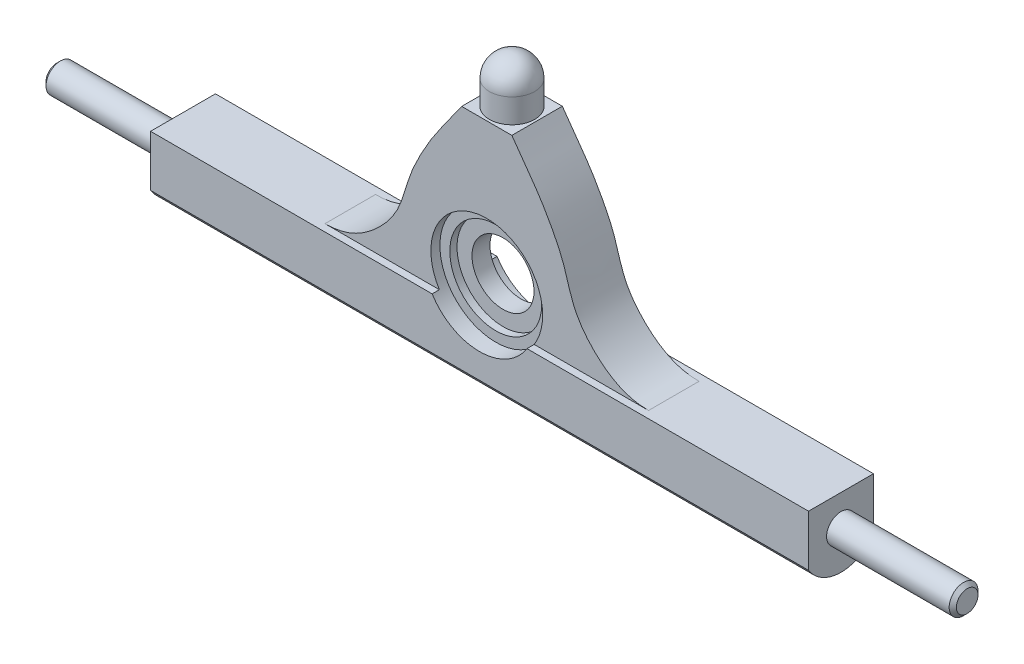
ISO-10303-21;
HEADER;
FILE_DESCRIPTION(('STEP AP214'),'2;1');
FILE_NAME('part.step','',(''),(''),'','','');
FILE_SCHEMA(('AUTOMOTIVE_DESIGN { 1 0 10303 214 1 1 1 1 }'));
ENDSEC;
DATA;
#1=APPLICATION_CONTEXT('core data for automotive mechanical design processes');
#2=APPLICATION_PROTOCOL_DEFINITION('international standard','automotive_design',2000,#1);
#3=PRODUCT_CONTEXT('',#1,'mechanical');
#4=PRODUCT('Part','Part','',(#3));
#5=PRODUCT_RELATED_PRODUCT_CATEGORY('part','',(#4));
#6=PRODUCT_DEFINITION_FORMATION('','',#4);
#7=PRODUCT_DEFINITION_CONTEXT('part definition',#1,'design');
#8=PRODUCT_DEFINITION('design','',#6,#7);
#9=PRODUCT_DEFINITION_SHAPE('','',#8);
#10=(LENGTH_UNIT() NAMED_UNIT(*) SI_UNIT(.MILLI.,.METRE.));
#11=(NAMED_UNIT(*) PLANE_ANGLE_UNIT() SI_UNIT($,.RADIAN.));
#12=(NAMED_UNIT(*) SI_UNIT($,.STERADIAN.) SOLID_ANGLE_UNIT());
#13=UNCERTAINTY_MEASURE_WITH_UNIT(LENGTH_MEASURE(1.E-05),#10,'distance_accuracy_value','');
#14=(GEOMETRIC_REPRESENTATION_CONTEXT(3) GLOBAL_UNCERTAINTY_ASSIGNED_CONTEXT((#13)) GLOBAL_UNIT_ASSIGNED_CONTEXT((#10,
#11,#12)) REPRESENTATION_CONTEXT('',''));
#15=CARTESIAN_POINT('',(0.,0.,0.));
#16=DIRECTION('',(0.,0.,1.));
#17=DIRECTION('',(1.,0.,0.));
#18=AXIS2_PLACEMENT_3D('',#15,#16,#17);
#19=CARTESIAN_POINT('',(0.,16.8,-9.));
#20=DIRECTION('',(0.,0.,1.));
#21=DIRECTION('',(1.,0.,0.));
#22=AXIS2_PLACEMENT_3D('',#19,#20,#21);
#23=CYLINDRICAL_SURFACE('',#22,8.6);
#24=CARTESIAN_POINT('',(0.,16.8,2.5));
#25=DIRECTION('',(0.,0.,1.));
#26=DIRECTION('',(1.,0.,0.));
#27=AXIS2_PLACEMENT_3D('',#24,#25,#26);
#28=CIRCLE('',#27,8.6);
#29=CARTESIAN_POINT('',(8.6,16.8,2.5));
#30=VERTEX_POINT('',#29);
#31=EDGE_CURVE('E167',#30,#30,#28,.F.);
#32=ORIENTED_EDGE('',*,*,#31,.F.);
#33=EDGE_LOOP('',(#32));
#34=FACE_BOUND('',#33,.T.);
#35=CARTESIAN_POINT('',(0.,16.8,-2.5));
#36=DIRECTION('',(0.,0.,-1.));
#37=DIRECTION('',(-1.,0.,0.));
#38=AXIS2_PLACEMENT_3D('',#35,#36,#37);
#39=CIRCLE('',#38,8.6);
#40=CARTESIAN_POINT('',(-8.59999999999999,16.8,-2.5));
#41=VERTEX_POINT('',#40);
#42=EDGE_CURVE('E129',#41,#41,#39,.F.);
#43=ORIENTED_EDGE('',*,*,#42,.F.);
#44=EDGE_LOOP('',(#43));
#45=FACE_BOUND('',#44,.T.);
#46=ADVANCED_FACE('F33',(#34,#45),#23,.F.);
#47=CARTESIAN_POINT('',(91.25,8.6,-9.));
#48=DIRECTION('',(0.,-1.,0.));
#49=DIRECTION('',(0.,0.,-1.));
#50=AXIS2_PLACEMENT_3D('',#47,#48,#49);
#51=PLANE('',#50);
#52=DIRECTION('',(0.,0.,-1.));
#53=VECTOR('',#52,1.);
#54=CARTESIAN_POINT('',(13.1533265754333,8.6,-4.5));
#55=LINE('',#54,#53);
#56=CARTESIAN_POINT('',(13.1533265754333,8.6,-7.));
#57=VERTEX_POINT('',#56);
#58=CARTESIAN_POINT('',(13.1533265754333,8.6,-9.));
#59=VERTEX_POINT('',#58);
#60=EDGE_CURVE('E123',#57,#59,#55,.T.);
#61=ORIENTED_EDGE('',*,*,#60,.F.);
#62=DIRECTION('',(1.,0.,0.));
#63=VECTOR('',#62,1.);
#64=CARTESIAN_POINT('',(44.8718331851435,8.6,-7.));
#65=LINE('',#64,#63);
#66=CARTESIAN_POINT('',(44.8718331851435,8.6,-7.));
#67=VERTEX_POINT('',#66);
#68=EDGE_CURVE('E248',#57,#67,#65,.T.);
#69=ORIENTED_EDGE('',*,*,#68,.T.);
#70=DIRECTION('',(0.,0.,-1.));
#71=VECTOR('',#70,1.);
#72=CARTESIAN_POINT('',(44.8718331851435,8.6,7.));
#73=LINE('',#72,#71);
#74=CARTESIAN_POINT('',(44.8718331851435,8.6,7.));
#75=VERTEX_POINT('',#74);
#76=EDGE_CURVE('E268',#75,#67,#73,.T.);
#77=ORIENTED_EDGE('',*,*,#76,.F.);
#78=DIRECTION('',(1.,0.,0.));
#79=VECTOR('',#78,1.);
#80=CARTESIAN_POINT('',(44.8718331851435,8.6,7.));
#81=LINE('',#80,#79);
#82=CARTESIAN_POINT('',(13.1533265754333,8.6,7.));
#83=VERTEX_POINT('',#82);
#84=EDGE_CURVE('E310',#83,#75,#81,.T.);
#85=ORIENTED_EDGE('',*,*,#84,.F.);
#86=DIRECTION('',(0.,0.,1.));
#87=VECTOR('',#86,1.);
#88=CARTESIAN_POINT('',(13.1533265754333,8.6,4.5));
#89=LINE('',#88,#87);
#90=CARTESIAN_POINT('',(13.1533265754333,8.6,9.));
#91=VERTEX_POINT('',#90);
#92=EDGE_CURVE('E56',#83,#91,#89,.T.);
#93=ORIENTED_EDGE('',*,*,#92,.T.);
#94=DIRECTION('',(-1.,0.,0.));
#95=VECTOR('',#94,1.);
#96=CARTESIAN_POINT('',(91.25,8.6,9.));
#97=LINE('',#96,#95);
#98=CARTESIAN_POINT('',(91.25,8.6,9.));
#99=VERTEX_POINT('',#98);
#100=EDGE_CURVE('E146',#99,#91,#97,.T.);
#101=ORIENTED_EDGE('',*,*,#100,.F.);
#102=DIRECTION('',(0.,0.,1.));
#103=VECTOR('',#102,1.);
#104=CARTESIAN_POINT('',(91.25,8.6,-9.));
#105=LINE('',#104,#103);
#106=CARTESIAN_POINT('',(91.25,8.6,-9.));
#107=VERTEX_POINT('',#106);
#108=EDGE_CURVE('E282',#107,#99,#105,.T.);
#109=ORIENTED_EDGE('',*,*,#108,.F.);
#110=DIRECTION('',(-1.,0.,0.));
#111=VECTOR('',#110,1.);
#112=CARTESIAN_POINT('',(91.25,8.6,-9.));
#113=LINE('',#112,#111);
#114=EDGE_CURVE('E145',#107,#59,#113,.T.);
#115=ORIENTED_EDGE('',*,*,#114,.T.);
#116=EDGE_LOOP('',(#61,#69,#77,#85,#93,#101,#109,#115));
#117=FACE_BOUND('',#116,.T.);
#118=ADVANCED_FACE('F196',(#117),#51,.F.);
#119=DIRECTION('',(0.,0.,-1.));
#120=VECTOR('',#119,1.);
#121=CARTESIAN_POINT('',(-13.1533265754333,8.6,-4.5));
#122=LINE('',#121,#120);
#123=CARTESIAN_POINT('',(-13.1533265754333,8.6,-9.));
#124=VERTEX_POINT('',#123);
#125=CARTESIAN_POINT('',(-13.1533265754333,8.6,-7.));
#126=VERTEX_POINT('',#125);
#127=EDGE_CURVE('E48',#124,#126,#122,.F.);
#128=ORIENTED_EDGE('',*,*,#127,.F.);
#129=CARTESIAN_POINT('',(-91.25,8.6,-9.));
#130=VERTEX_POINT('',#129);
#131=EDGE_CURVE('E135',#124,#130,#113,.T.);
#132=ORIENTED_EDGE('',*,*,#131,.T.);
#133=DIRECTION('',(0.,0.,1.));
#134=VECTOR('',#133,1.);
#135=CARTESIAN_POINT('',(-91.25,8.6,-9.));
#136=LINE('',#135,#134);
#137=CARTESIAN_POINT('',(-91.25,8.6,9.));
#138=VERTEX_POINT('',#137);
#139=EDGE_CURVE('E278',#130,#138,#136,.T.);
#140=ORIENTED_EDGE('',*,*,#139,.T.);
#141=CARTESIAN_POINT('',(-13.1533265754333,8.6,9.));
#142=VERTEX_POINT('',#141);
#143=EDGE_CURVE('E150',#142,#138,#97,.T.);
#144=ORIENTED_EDGE('',*,*,#143,.F.);
#145=DIRECTION('',(0.,0.,1.));
#146=VECTOR('',#145,1.);
#147=CARTESIAN_POINT('',(-13.1533265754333,8.6,4.5));
#148=LINE('',#147,#146);
#149=CARTESIAN_POINT('',(-13.1533265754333,8.6,7.));
#150=VERTEX_POINT('',#149);
#151=EDGE_CURVE('E302',#142,#150,#148,.F.);
#152=ORIENTED_EDGE('',*,*,#151,.T.);
#153=CARTESIAN_POINT('',(-44.8718331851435,8.6,7.));
#154=VERTEX_POINT('',#153);
#155=EDGE_CURVE('E237',#154,#150,#81,.T.);
#156=ORIENTED_EDGE('',*,*,#155,.F.);
#157=DIRECTION('',(0.,0.,-1.));
#158=VECTOR('',#157,1.);
#159=CARTESIAN_POINT('',(-44.8718331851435,8.6,7.));
#160=LINE('',#159,#158);
#161=CARTESIAN_POINT('',(-44.8718331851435,8.6,-7.));
#162=VERTEX_POINT('',#161);
#163=EDGE_CURVE('E271',#154,#162,#160,.T.);
#164=ORIENTED_EDGE('',*,*,#163,.T.);
#165=EDGE_CURVE('E138',#162,#126,#65,.T.);
#166=ORIENTED_EDGE('',*,*,#165,.T.);
#167=EDGE_LOOP('',(#128,#132,#140,#144,#152,#156,#164,#166));
#168=FACE_BOUND('',#167,.T.);
#169=ADVANCED_FACE('F133',(#168),#51,.F.);
#170=CARTESIAN_POINT('',(126.25,0.,0.));
#171=DIRECTION('',(1.,0.,0.));
#172=DIRECTION('',(0.,0.,-1.));
#173=AXIS2_PLACEMENT_3D('',#170,#171,#172);
#174=CYLINDRICAL_SURFACE('',#173,4.00000000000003);
#175=CARTESIAN_POINT('',(125.25,0.,0.));
#176=DIRECTION('',(1.,0.,0.));
#177=DIRECTION('',(0.,0.,-1.));
#178=AXIS2_PLACEMENT_3D('',#175,#176,#177);
#179=CIRCLE('',#178,4.00000000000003);
#180=CARTESIAN_POINT('',(125.25,0.,-4.00000000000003));
#181=VERTEX_POINT('',#180);
#182=EDGE_CURVE('E11',#181,#181,#179,.F.);
#183=ORIENTED_EDGE('',*,*,#182,.T.);
#184=EDGE_LOOP('',(#183));
#185=FACE_BOUND('',#184,.T.);
#186=CARTESIAN_POINT('',(91.25,0.,0.));
#187=DIRECTION('',(-1.,0.,0.));
#188=DIRECTION('',(0.,0.,1.));
#189=AXIS2_PLACEMENT_3D('',#186,#187,#188);
#190=CIRCLE('',#189,4.00000000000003);
#191=CARTESIAN_POINT('',(91.25,0.,4.00000000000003));
#192=VERTEX_POINT('',#191);
#193=EDGE_CURVE('E158',#192,#192,#190,.F.);
#194=ORIENTED_EDGE('',*,*,#193,.T.);
#195=EDGE_LOOP('',(#194));
#196=FACE_BOUND('',#195,.T.);
#197=ADVANCED_FACE('F429',(#185,#196),#174,.T.);
#198=CARTESIAN_POINT('',(126.25,4.,0.));
#199=DIRECTION('',(1.,0.,0.));
#200=DIRECTION('',(0.,0.,-1.));
#201=AXIS2_PLACEMENT_3D('',#198,#199,#200);
#202=PLANE('',#201);
#203=CARTESIAN_POINT('',(126.25,0.,0.));
#204=DIRECTION('',(1.,0.,0.));
#205=DIRECTION('',(0.,0.,-1.));
#206=AXIS2_PLACEMENT_3D('',#203,#204,#205);
#207=CIRCLE('',#206,3.00000000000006);
#208=CARTESIAN_POINT('',(126.25,0.,-3.00000000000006));
#209=VERTEX_POINT('',#208);
#210=EDGE_CURVE('E41',#209,#209,#207,.T.);
#211=ORIENTED_EDGE('',*,*,#210,.T.);
#212=EDGE_LOOP('',(#211));
#213=FACE_BOUND('',#212,.T.);
#214=ADVANCED_FACE('F184',(#213),#202,.T.);
#215=CARTESIAN_POINT('',(91.25,8.6,9.));
#216=DIRECTION('',(0.,0.,-1.));
#217=DIRECTION('',(0.,1.,0.));
#218=AXIS2_PLACEMENT_3D('',#215,#216,#217);
#219=PLANE('',#218);
#220=ORIENTED_EDGE('',*,*,#100,.T.);
#221=CARTESIAN_POINT('',(0.,16.8,9.));
#222=DIRECTION('',(0.,0.,1.));
#223=DIRECTION('',(1.,0.,0.));
#224=AXIS2_PLACEMENT_3D('',#221,#222,#223);
#225=CIRCLE('',#224,15.5);
#226=EDGE_CURVE('E170',#142,#91,#225,.T.);
#227=ORIENTED_EDGE('',*,*,#226,.F.);
#228=ORIENTED_EDGE('',*,*,#143,.T.);
#229=DIRECTION('',(0.,-1.,0.));
#230=VECTOR('',#229,1.);
#231=CARTESIAN_POINT('',(-91.25,8.6,9.));
#232=LINE('',#231,#230);
#233=CARTESIAN_POINT('',(-91.25,-5.6,9.));
#234=VERTEX_POINT('',#233);
#235=EDGE_CURVE('E273',#138,#234,#232,.T.);
#236=ORIENTED_EDGE('',*,*,#235,.T.);
#237=DIRECTION('',(-1.,0.,0.));
#238=VECTOR('',#237,1.);
#239=CARTESIAN_POINT('',(91.25,-5.6,9.));
#240=LINE('',#239,#238);
#241=CARTESIAN_POINT('',(91.25,-5.6,9.));
#242=VERTEX_POINT('',#241);
#243=EDGE_CURVE('E155',#242,#234,#240,.T.);
#244=ORIENTED_EDGE('',*,*,#243,.F.);
#245=DIRECTION('',(0.,-1.,0.));
#246=VECTOR('',#245,1.);
#247=CARTESIAN_POINT('',(91.25,8.6,9.));
#248=LINE('',#247,#246);
#249=EDGE_CURVE('E274',#99,#242,#248,.T.);
#250=ORIENTED_EDGE('',*,*,#249,.F.);
#251=EDGE_LOOP('',(#220,#227,#228,#236,#244,#250));
#252=FACE_BOUND('',#251,.T.);
#253=ADVANCED_FACE('F295',(#252),#219,.F.);
#254=CARTESIAN_POINT('',(91.25,0.,0.));
#255=DIRECTION('',(-1.,0.,0.));
#256=DIRECTION('',(0.,0.,1.));
#257=AXIS2_PLACEMENT_3D('',#254,#255,#256);
#258=CYLINDRICAL_SURFACE('',#257,10.6);
#259=CARTESIAN_POINT('',(-91.25,0.,0.));
#260=DIRECTION('',(1.,0.,0.));
#261=DIRECTION('',(0.,0.,1.));
#262=AXIS2_PLACEMENT_3D('',#259,#260,#261);
#263=CIRCLE('',#262,10.6);
#264=CARTESIAN_POINT('',(-91.25,-5.6,-9.));
#265=VERTEX_POINT('',#264);
#266=EDGE_CURVE('E286',#234,#265,#263,.T.);
#267=ORIENTED_EDGE('',*,*,#266,.T.);
#268=DIRECTION('',(-1.,0.,0.));
#269=VECTOR('',#268,1.);
#270=CARTESIAN_POINT('',(91.25,-5.6,-9.));
#271=LINE('',#270,#269);
#272=CARTESIAN_POINT('',(91.25,-5.6,-9.));
#273=VERTEX_POINT('',#272);
#274=EDGE_CURVE('E148',#273,#265,#271,.T.);
#275=ORIENTED_EDGE('',*,*,#274,.F.);
#276=CARTESIAN_POINT('',(91.25,0.,0.));
#277=DIRECTION('',(1.,0.,0.));
#278=DIRECTION('',(0.,0.,1.));
#279=AXIS2_PLACEMENT_3D('',#276,#277,#278);
#280=CIRCLE('',#279,10.6);
#281=EDGE_CURVE('E277',#242,#273,#280,.T.);
#282=ORIENTED_EDGE('',*,*,#281,.F.);
#283=ORIENTED_EDGE('',*,*,#243,.T.);
#284=EDGE_LOOP('',(#267,#275,#282,#283));
#285=FACE_BOUND('',#284,.T.);
#286=ADVANCED_FACE('F411',(#285),#258,.T.);
#287=CARTESIAN_POINT('',(91.25,8.6,-9.));
#288=DIRECTION('',(0.,0.,1.));
#289=DIRECTION('',(0.,-1.,0.));
#290=AXIS2_PLACEMENT_3D('',#287,#288,#289);
#291=PLANE('',#290);
#292=CARTESIAN_POINT('',(0.,16.8,-9.));
#293=DIRECTION('',(0.,0.,1.));
#294=DIRECTION('',(1.,0.,0.));
#295=AXIS2_PLACEMENT_3D('',#292,#293,#294);
#296=CIRCLE('',#295,15.5);
#297=EDGE_CURVE('E120',#124,#59,#296,.T.);
#298=ORIENTED_EDGE('',*,*,#297,.T.);
#299=ORIENTED_EDGE('',*,*,#114,.F.);
#300=DIRECTION('',(0.,1.,0.));
#301=VECTOR('',#300,1.);
#302=CARTESIAN_POINT('',(91.25,8.6,-9.));
#303=LINE('',#302,#301);
#304=EDGE_CURVE('E280',#273,#107,#303,.T.);
#305=ORIENTED_EDGE('',*,*,#304,.F.);
#306=ORIENTED_EDGE('',*,*,#274,.T.);
#307=DIRECTION('',(0.,1.,0.));
#308=VECTOR('',#307,1.);
#309=CARTESIAN_POINT('',(-91.25,8.6,-9.));
#310=LINE('',#309,#308);
#311=EDGE_CURVE('E143',#265,#130,#310,.T.);
#312=ORIENTED_EDGE('',*,*,#311,.T.);
#313=ORIENTED_EDGE('',*,*,#131,.F.);
#314=EDGE_LOOP('',(#298,#299,#305,#306,#312,#313));
#315=FACE_BOUND('',#314,.T.);
#316=ADVANCED_FACE('F140',(#315),#291,.F.);
#317=CARTESIAN_POINT('',(91.25,0.,0.));
#318=DIRECTION('',(-1.,0.,0.));
#319=DIRECTION('',(0.,0.,1.));
#320=AXIS2_PLACEMENT_3D('',#317,#318,#319);
#321=PLANE('',#320);
#322=ORIENTED_EDGE('',*,*,#193,.F.);
#323=EDGE_LOOP('',(#322));
#324=FACE_BOUND('',#323,.T.);
#325=ORIENTED_EDGE('',*,*,#249,.T.);
#326=ORIENTED_EDGE('',*,*,#281,.T.);
#327=ORIENTED_EDGE('',*,*,#304,.T.);
#328=ORIENTED_EDGE('',*,*,#108,.T.);
#329=EDGE_LOOP('',(#325,#326,#327,#328));
#330=FACE_BOUND('',#329,.T.);
#331=ADVANCED_FACE('F409',(#324,#330),#321,.F.);
#332=CARTESIAN_POINT('',(-91.25,0.,0.));
#333=DIRECTION('',(-1.,0.,0.));
#334=DIRECTION('',(0.,0.,1.));
#335=AXIS2_PLACEMENT_3D('',#332,#333,#334);
#336=PLANE('',#335);
#337=CARTESIAN_POINT('',(-91.25,0.,0.));
#338=DIRECTION('',(-1.,0.,0.));
#339=DIRECTION('',(0.,0.,1.));
#340=AXIS2_PLACEMENT_3D('',#337,#338,#339);
#341=CIRCLE('',#340,4.00000000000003);
#342=CARTESIAN_POINT('',(-91.25,0.,4.00000000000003));
#343=VERTEX_POINT('',#342);
#344=EDGE_CURVE('E159',#343,#343,#341,.F.);
#345=ORIENTED_EDGE('',*,*,#344,.T.);
#346=EDGE_LOOP('',(#345));
#347=FACE_BOUND('',#346,.T.);
#348=ORIENTED_EDGE('',*,*,#235,.F.);
#349=ORIENTED_EDGE('',*,*,#139,.F.);
#350=ORIENTED_EDGE('',*,*,#311,.F.);
#351=ORIENTED_EDGE('',*,*,#266,.F.);
#352=EDGE_LOOP('',(#348,#349,#350,#351));
#353=FACE_BOUND('',#352,.T.);
#354=ADVANCED_FACE('F292',(#347,#353),#336,.T.);
#355=CARTESIAN_POINT('',(-126.25,4.,0.));
#356=DIRECTION('',(-1.,0.,0.));
#357=DIRECTION('',(0.,0.,1.));
#358=AXIS2_PLACEMENT_3D('',#355,#356,#357);
#359=PLANE('',#358);
#360=CARTESIAN_POINT('',(-126.25,0.,0.));
#361=DIRECTION('',(-1.,0.,0.));
#362=DIRECTION('',(0.,0.,1.));
#363=AXIS2_PLACEMENT_3D('',#360,#361,#362);
#364=CIRCLE('',#363,3.);
#365=CARTESIAN_POINT('',(-126.25,0.,3.));
#366=VERTEX_POINT('',#365);
#367=EDGE_CURVE('E179',#366,#366,#364,.T.);
#368=ORIENTED_EDGE('',*,*,#367,.T.);
#369=EDGE_LOOP('',(#368));
#370=FACE_BOUND('',#369,.T.);
#371=ADVANCED_FACE('F421',(#370),#359,.T.);
#372=CARTESIAN_POINT('',(-125.25,0.,0.));
#373=DIRECTION('',(-1.,0.,0.));
#374=DIRECTION('',(0.,0.,1.));
#375=AXIS2_PLACEMENT_3D('',#372,#373,#374);
#376=CIRCLE('',#375,4.00000000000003);
#377=CARTESIAN_POINT('',(-125.25,0.,4.00000000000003));
#378=VERTEX_POINT('',#377);
#379=EDGE_CURVE('E173',#378,#378,#376,.F.);
#380=ORIENTED_EDGE('',*,*,#379,.T.);
#381=EDGE_LOOP('',(#380));
#382=FACE_BOUND('',#381,.T.);
#383=ORIENTED_EDGE('',*,*,#344,.F.);
#384=EDGE_LOOP('',(#383));
#385=FACE_BOUND('',#384,.T.);
#386=ADVANCED_FACE('F424',(#382,#385),#174,.T.);
#387=CARTESIAN_POINT('',(-6.95909931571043,55.7253240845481,7.));
#388=CARTESIAN_POINT('',(-9.56103925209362,51.9184136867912,7.));
#389=CARTESIAN_POINT('',(-14.2518040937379,45.9423207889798,7.));
#390=CARTESIAN_POINT('',(-18.6600474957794,38.0647557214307,7.));
#391=CARTESIAN_POINT('',(-22.0038736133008,30.8318923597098,7.));
#392=CARTESIAN_POINT('',(-23.579730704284,22.7426069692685,7.));
#393=CARTESIAN_POINT('',(-29.6946316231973,14.7882180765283,7.));
#394=CARTESIAN_POINT('',(-36.9568552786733,9.57509866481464,7.));
#395=CARTESIAN_POINT('',(-42.369002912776,8.6,7.));
#396=CARTESIAN_POINT('',(-44.8718331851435,8.6,7.));
#397=B_SPLINE_CURVE_WITH_KNOTS('',3,(#387,#388,#389,#390,#391,#392,#393,#394,#395,#396),
.UNSPECIFIED.,.F.,.F.,(4,1,1,1,1,1,1,4),(0.,0.217701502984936,0.357323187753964,
0.424819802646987,0.593326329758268,0.737936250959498,0.888571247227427,1.),.UNSPECIFIED.);
#398=DIRECTION('',(0.,0.,-1.));
#399=VECTOR('',#398,1.);
#400=SURFACE_OF_LINEAR_EXTRUSION('',#397,#399);
#401=CARTESIAN_POINT('',(-6.95909931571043,55.7253240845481,-7.));
#402=CARTESIAN_POINT('',(-9.56103925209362,51.9184136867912,-7.));
#403=CARTESIAN_POINT('',(-14.2518040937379,45.9423207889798,-7.));
#404=CARTESIAN_POINT('',(-18.6600474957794,38.0647557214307,-7.));
#405=CARTESIAN_POINT('',(-22.0038736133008,30.8318923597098,-7.));
#406=CARTESIAN_POINT('',(-23.579730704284,22.7426069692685,-7.));
#407=CARTESIAN_POINT('',(-29.6946316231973,14.7882180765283,-7.));
#408=CARTESIAN_POINT('',(-36.9568552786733,9.57509866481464,-7.));
#409=CARTESIAN_POINT('',(-42.369002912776,8.6,-7.));
#410=CARTESIAN_POINT('',(-44.8718331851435,8.6,-7.));
#411=B_SPLINE_CURVE_WITH_KNOTS('',3,(#401,#402,#403,#404,#405,#406,#407,#408,#409,#410),
.UNSPECIFIED.,.F.,.F.,(4,1,1,1,1,1,1,4),(0.,0.217701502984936,0.357323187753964,
0.424819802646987,0.593326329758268,0.737936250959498,0.888571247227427,1.),.UNSPECIFIED.);
#412=CARTESIAN_POINT('',(-6.95909931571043,55.7253240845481,-7.));
#413=VERTEX_POINT('',#412);
#414=EDGE_CURVE('E243',#413,#162,#411,.T.);
#415=ORIENTED_EDGE('',*,*,#414,.T.);
#416=ORIENTED_EDGE('',*,*,#163,.F.);
#417=CARTESIAN_POINT('',(-6.95909931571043,55.7253240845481,7.));
#418=VERTEX_POINT('',#417);
#419=EDGE_CURVE('E262',#418,#154,#397,.T.);
#420=ORIENTED_EDGE('',*,*,#419,.F.);
#421=DIRECTION('',(0.,0.,-1.));
#422=VECTOR('',#421,1.);
#423=CARTESIAN_POINT('',(-6.95909931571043,55.7253240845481,7.));
#424=LINE('',#423,#422);
#425=EDGE_CURVE('E242',#418,#413,#424,.T.);
#426=ORIENTED_EDGE('',*,*,#425,.T.);
#427=EDGE_LOOP('',(#415,#416,#420,#426));
#428=FACE_BOUND('',#427,.T.);
#429=ADVANCED_FACE('F226',(#428),#400,.F.);
#430=CARTESIAN_POINT('',(44.8718331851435,8.6,7.));
#431=CARTESIAN_POINT('',(42.369002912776,8.6,7.));
#432=CARTESIAN_POINT('',(36.9568552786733,9.57509866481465,7.));
#433=CARTESIAN_POINT('',(29.6946316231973,14.7882180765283,7.));
#434=CARTESIAN_POINT('',(23.579730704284,22.7426069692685,7.));
#435=CARTESIAN_POINT('',(22.0038736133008,30.8318923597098,7.));
#436=CARTESIAN_POINT('',(18.6600474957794,38.0647557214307,7.));
#437=CARTESIAN_POINT('',(14.2518040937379,45.9423207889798,7.));
#438=CARTESIAN_POINT('',(9.56103925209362,51.9184136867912,7.));
#439=CARTESIAN_POINT('',(6.95909931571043,55.7253240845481,7.));
#440=B_SPLINE_CURVE_WITH_KNOTS('',3,(#430,#431,#432,#433,#434,#435,#436,#437,#438,#439),
.UNSPECIFIED.,.F.,.F.,(4,1,1,1,1,1,1,4),(0.,0.111428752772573,0.262063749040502,
0.406673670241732,0.575180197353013,0.642676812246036,0.782298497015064,1.),.UNSPECIFIED.);
#441=DIRECTION('',(0.,0.,-1.));
#442=VECTOR('',#441,1.);
#443=SURFACE_OF_LINEAR_EXTRUSION('',#440,#442);
#444=CARTESIAN_POINT('',(44.8718331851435,8.6,-7.));
#445=CARTESIAN_POINT('',(42.369002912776,8.6,-7.));
#446=CARTESIAN_POINT('',(36.9568552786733,9.57509866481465,-7.));
#447=CARTESIAN_POINT('',(29.6946316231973,14.7882180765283,-7.));
#448=CARTESIAN_POINT('',(23.579730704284,22.7426069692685,-7.));
#449=CARTESIAN_POINT('',(22.0038736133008,30.8318923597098,-7.));
#450=CARTESIAN_POINT('',(18.6600474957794,38.0647557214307,-7.));
#451=CARTESIAN_POINT('',(14.2518040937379,45.9423207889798,-7.));
#452=CARTESIAN_POINT('',(9.56103925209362,51.9184136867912,-7.));
#453=CARTESIAN_POINT('',(6.95909931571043,55.7253240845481,-7.));
#454=B_SPLINE_CURVE_WITH_KNOTS('',3,(#444,#445,#446,#447,#448,#449,#450,#451,#452,#453),
.UNSPECIFIED.,.F.,.F.,(4,1,1,1,1,1,1,4),(0.,0.111428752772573,0.262063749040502,
0.406673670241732,0.575180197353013,0.642676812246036,0.782298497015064,1.),.UNSPECIFIED.);
#455=CARTESIAN_POINT('',(6.95909931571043,55.7253240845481,-7.));
#456=VERTEX_POINT('',#455);
#457=EDGE_CURVE('E253',#67,#456,#454,.T.);
#458=ORIENTED_EDGE('',*,*,#457,.T.);
#459=DIRECTION('',(0.,0.,-1.));
#460=VECTOR('',#459,1.);
#461=CARTESIAN_POINT('',(6.95909931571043,55.7253240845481,7.));
#462=LINE('',#461,#460);
#463=CARTESIAN_POINT('',(6.95909931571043,55.7253240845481,7.));
#464=VERTEX_POINT('',#463);
#465=EDGE_CURVE('E265',#464,#456,#462,.T.);
#466=ORIENTED_EDGE('',*,*,#465,.F.);
#467=EDGE_CURVE('E230',#75,#464,#440,.T.);
#468=ORIENTED_EDGE('',*,*,#467,.F.);
#469=ORIENTED_EDGE('',*,*,#76,.T.);
#470=EDGE_LOOP('',(#458,#466,#468,#469));
#471=FACE_BOUND('',#470,.T.);
#472=ADVANCED_FACE('F221',(#471),#443,.F.);
#473=CARTESIAN_POINT('',(-6.95909931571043,55.7253240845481,7.));
#474=DIRECTION('',(0.,-1.,0.));
#475=DIRECTION('',(0.,0.,-1.));
#476=AXIS2_PLACEMENT_3D('',#473,#474,#475);
#477=PLANE('',#476);
#478=CARTESIAN_POINT('',(0.,55.7253240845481,0.));
#479=DIRECTION('',(0.,1.,0.));
#480=DIRECTION('',(-1.,0.,0.));
#481=AXIS2_PLACEMENT_3D('',#478,#479,#480);
#482=CIRCLE('',#481,6.3);
#483=CARTESIAN_POINT('',(-6.3,55.7253240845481,0.));
#484=VERTEX_POINT('',#483);
#485=EDGE_CURVE('E368',#484,#484,#482,.T.);
#486=ORIENTED_EDGE('',*,*,#485,.F.);
#487=EDGE_LOOP('',(#486));
#488=FACE_BOUND('',#487,.T.);
#489=DIRECTION('',(-1.,0.,0.));
#490=VECTOR('',#489,1.);
#491=CARTESIAN_POINT('',(-6.95909931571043,55.7253240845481,-7.));
#492=LINE('',#491,#490);
#493=EDGE_CURVE('E257',#456,#413,#492,.T.);
#494=ORIENTED_EDGE('',*,*,#493,.T.);
#495=ORIENTED_EDGE('',*,*,#425,.F.);
#496=DIRECTION('',(-1.,0.,0.));
#497=VECTOR('',#496,1.);
#498=CARTESIAN_POINT('',(-6.95909931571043,55.7253240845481,7.));
#499=LINE('',#498,#497);
#500=EDGE_CURVE('E236',#464,#418,#499,.T.);
#501=ORIENTED_EDGE('',*,*,#500,.F.);
#502=ORIENTED_EDGE('',*,*,#465,.T.);
#503=EDGE_LOOP('',(#494,#495,#501,#502));
#504=FACE_BOUND('',#503,.T.);
#505=ADVANCED_FACE('F214',(#488,#504),#477,.F.);
#506=CARTESIAN_POINT('',(-22.4949883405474,28.1773980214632,7.));
#507=DIRECTION('',(0.,0.,-1.));
#508=DIRECTION('',(-1.,0.,0.));
#509=AXIS2_PLACEMENT_3D('',#506,#507,#508);
#510=PLANE('',#509);
#511=ORIENTED_EDGE('',*,*,#155,.T.);
#512=CARTESIAN_POINT('',(0.,16.8,7.));
#513=DIRECTION('',(0.,0.,-1.));
#514=DIRECTION('',(-1.,0.,0.));
#515=AXIS2_PLACEMENT_3D('',#512,#513,#514);
#516=CIRCLE('',#515,15.5);
#517=EDGE_CURVE('E162',#150,#83,#516,.T.);
#518=ORIENTED_EDGE('',*,*,#517,.T.);
#519=ORIENTED_EDGE('',*,*,#84,.T.);
#520=ORIENTED_EDGE('',*,*,#467,.T.);
#521=ORIENTED_EDGE('',*,*,#500,.T.);
#522=ORIENTED_EDGE('',*,*,#419,.T.);
#523=EDGE_LOOP('',(#511,#518,#519,#520,#521,#522));
#524=FACE_BOUND('',#523,.T.);
#525=ADVANCED_FACE('F210',(#524),#510,.F.);
#526=CARTESIAN_POINT('',(-22.4949883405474,28.1773980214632,-7.));
#527=DIRECTION('',(0.,0.,-1.));
#528=DIRECTION('',(-1.,0.,0.));
#529=AXIS2_PLACEMENT_3D('',#526,#527,#528);
#530=PLANE('',#529);
#531=ORIENTED_EDGE('',*,*,#68,.F.);
#532=CARTESIAN_POINT('',(0.,16.8,-7.));
#533=DIRECTION('',(0.,0.,-1.));
#534=DIRECTION('',(-1.,0.,0.));
#535=AXIS2_PLACEMENT_3D('',#532,#533,#534);
#536=CIRCLE('',#535,15.5);
#537=EDGE_CURVE('E166',#57,#126,#536,.F.);
#538=ORIENTED_EDGE('',*,*,#537,.T.);
#539=ORIENTED_EDGE('',*,*,#165,.F.);
#540=ORIENTED_EDGE('',*,*,#414,.F.);
#541=ORIENTED_EDGE('',*,*,#493,.F.);
#542=ORIENTED_EDGE('',*,*,#457,.F.);
#543=EDGE_LOOP('',(#531,#538,#539,#540,#541,#542));
#544=FACE_BOUND('',#543,.T.);
#545=ADVANCED_FACE('F213',(#544),#530,.T.);
#546=CARTESIAN_POINT('',(0.,16.8,4.5));
#547=DIRECTION('',(0.,0.,1.));
#548=DIRECTION('',(1.,0.,0.));
#549=AXIS2_PLACEMENT_3D('',#546,#547,#548);
#550=CYLINDRICAL_SURFACE('',#549,15.5);
#551=CARTESIAN_POINT('',(0.,16.8,4.5));
#552=DIRECTION('',(0.,0.,1.));
#553=DIRECTION('',(1.,0.,0.));
#554=AXIS2_PLACEMENT_3D('',#551,#552,#553);
#555=CIRCLE('',#554,15.5);
#556=CARTESIAN_POINT('',(15.5,16.8,4.5));
#557=VERTEX_POINT('',#556);
#558=EDGE_CURVE('E299',#557,#557,#555,.T.);
#559=ORIENTED_EDGE('',*,*,#558,.F.);
#560=EDGE_LOOP('',(#559));
#561=FACE_BOUND('',#560,.T.);
#562=ORIENTED_EDGE('',*,*,#517,.F.);
#563=ORIENTED_EDGE('',*,*,#151,.F.);
#564=ORIENTED_EDGE('',*,*,#226,.T.);
#565=ORIENTED_EDGE('',*,*,#92,.F.);
#566=EDGE_LOOP('',(#562,#563,#564,#565));
#567=FACE_BOUND('',#566,.T.);
#568=ADVANCED_FACE('F208',(#561,#567),#550,.F.);
#569=CARTESIAN_POINT('',(0.,16.8,4.5));
#570=DIRECTION('',(0.,0.,1.));
#571=DIRECTION('',(1.,0.,0.));
#572=AXIS2_PLACEMENT_3D('',#569,#570,#571);
#573=PLANE('',#572);
#574=CARTESIAN_POINT('',(0.,16.8,4.5));
#575=DIRECTION('',(0.,0.,1.));
#576=DIRECTION('',(1.,0.,0.));
#577=AXIS2_PLACEMENT_3D('',#574,#575,#576);
#578=CIRCLE('',#577,12.75);
#579=CARTESIAN_POINT('',(12.75,16.8,4.5));
#580=VERTEX_POINT('',#579);
#581=EDGE_CURVE('E381',#580,#580,#578,.T.);
#582=ORIENTED_EDGE('',*,*,#581,.F.);
#583=EDGE_LOOP('',(#582));
#584=FACE_BOUND('',#583,.T.);
#585=ORIENTED_EDGE('',*,*,#558,.T.);
#586=EDGE_LOOP('',(#585));
#587=FACE_BOUND('',#586,.T.);
#588=ADVANCED_FACE('F321',(#584,#587),#573,.T.);
#589=CARTESIAN_POINT('',(0.,16.8,2.5));
#590=DIRECTION('',(0.,0.,1.));
#591=DIRECTION('',(1.,0.,0.));
#592=AXIS2_PLACEMENT_3D('',#589,#590,#591);
#593=PLANE('',#592);
#594=CARTESIAN_POINT('',(0.,16.8,2.5));
#595=DIRECTION('',(0.,0.,1.));
#596=DIRECTION('',(1.,0.,0.));
#597=AXIS2_PLACEMENT_3D('',#594,#595,#596);
#598=CIRCLE('',#597,12.75);
#599=CARTESIAN_POINT('',(12.75,16.8,2.5));
#600=VERTEX_POINT('',#599);
#601=EDGE_CURVE('E171',#600,#600,#598,.T.);
#602=ORIENTED_EDGE('',*,*,#601,.T.);
#603=EDGE_LOOP('',(#602));
#604=FACE_BOUND('',#603,.T.);
#605=ORIENTED_EDGE('',*,*,#31,.T.);
#606=EDGE_LOOP('',(#605));
#607=FACE_BOUND('',#606,.T.);
#608=ADVANCED_FACE('F326',(#604,#607),#593,.T.);
#609=CARTESIAN_POINT('',(0.,16.8,2.5));
#610=DIRECTION('',(0.,0.,1.));
#611=DIRECTION('',(1.,0.,0.));
#612=AXIS2_PLACEMENT_3D('',#609,#610,#611);
#613=CYLINDRICAL_SURFACE('',#612,12.75);
#614=ORIENTED_EDGE('',*,*,#601,.F.);
#615=EDGE_LOOP('',(#614));
#616=FACE_BOUND('',#615,.T.);
#617=ORIENTED_EDGE('',*,*,#581,.T.);
#618=EDGE_LOOP('',(#617));
#619=FACE_BOUND('',#618,.T.);
#620=ADVANCED_FACE('F333',(#616,#619),#613,.F.);
#621=CARTESIAN_POINT('',(0.,16.8,-4.5));
#622=DIRECTION('',(0.,0.,-1.));
#623=DIRECTION('',(1.,0.,0.));
#624=AXIS2_PLACEMENT_3D('',#621,#622,#623);
#625=PLANE('',#624);
#626=CARTESIAN_POINT('',(0.,16.8,-4.5));
#627=DIRECTION('',(0.,0.,1.));
#628=DIRECTION('',(1.,0.,0.));
#629=AXIS2_PLACEMENT_3D('',#626,#627,#628);
#630=CIRCLE('',#629,12.75);
#631=CARTESIAN_POINT('',(12.75,16.8,-4.5));
#632=VERTEX_POINT('',#631);
#633=EDGE_CURVE('E371',#632,#632,#630,.T.);
#634=ORIENTED_EDGE('',*,*,#633,.T.);
#635=EDGE_LOOP('',(#634));
#636=FACE_BOUND('',#635,.T.);
#637=CARTESIAN_POINT('',(0.,16.8,-4.5));
#638=DIRECTION('',(0.,0.,1.));
#639=DIRECTION('',(1.,0.,0.));
#640=AXIS2_PLACEMENT_3D('',#637,#638,#639);
#641=CIRCLE('',#640,15.5);
#642=CARTESIAN_POINT('',(15.5,16.8,-4.5));
#643=VERTEX_POINT('',#642);
#644=EDGE_CURVE('E128',#643,#643,#641,.T.);
#645=ORIENTED_EDGE('',*,*,#644,.F.);
#646=EDGE_LOOP('',(#645));
#647=FACE_BOUND('',#646,.T.);
#648=ADVANCED_FACE('F339',(#636,#647),#625,.T.);
#649=CARTESIAN_POINT('',(0.,16.8,-4.5));
#650=DIRECTION('',(0.,0.,-1.));
#651=DIRECTION('',(-1.,0.,0.));
#652=AXIS2_PLACEMENT_3D('',#649,#650,#651);
#653=CYLINDRICAL_SURFACE('',#652,15.5);
#654=ORIENTED_EDGE('',*,*,#644,.T.);
#655=EDGE_LOOP('',(#654));
#656=FACE_BOUND('',#655,.T.);
#657=ORIENTED_EDGE('',*,*,#60,.T.);
#658=ORIENTED_EDGE('',*,*,#297,.F.);
#659=ORIENTED_EDGE('',*,*,#127,.T.);
#660=ORIENTED_EDGE('',*,*,#537,.F.);
#661=EDGE_LOOP('',(#657,#658,#659,#660));
#662=FACE_BOUND('',#661,.T.);
#663=ADVANCED_FACE('F121',(#656,#662),#653,.F.);
#664=CARTESIAN_POINT('',(0.,16.8,-2.5));
#665=DIRECTION('',(0.,0.,-1.));
#666=DIRECTION('',(1.,0.,0.));
#667=AXIS2_PLACEMENT_3D('',#664,#665,#666);
#668=PLANE('',#667);
#669=CARTESIAN_POINT('',(0.,16.8,-2.5));
#670=DIRECTION('',(0.,0.,1.));
#671=DIRECTION('',(1.,0.,0.));
#672=AXIS2_PLACEMENT_3D('',#669,#670,#671);
#673=CIRCLE('',#672,12.75);
#674=CARTESIAN_POINT('',(12.75,16.8,-2.5));
#675=VERTEX_POINT('',#674);
#676=EDGE_CURVE('E176',#675,#675,#673,.T.);
#677=ORIENTED_EDGE('',*,*,#676,.F.);
#678=EDGE_LOOP('',(#677));
#679=FACE_BOUND('',#678,.T.);
#680=ORIENTED_EDGE('',*,*,#42,.T.);
#681=EDGE_LOOP('',(#680));
#682=FACE_BOUND('',#681,.T.);
#683=ADVANCED_FACE('F344',(#679,#682),#668,.T.);
#684=CARTESIAN_POINT('',(0.,16.8,-2.5));
#685=DIRECTION('',(0.,0.,-1.));
#686=DIRECTION('',(-1.,0.,0.));
#687=AXIS2_PLACEMENT_3D('',#684,#685,#686);
#688=CYLINDRICAL_SURFACE('',#687,12.75);
#689=ORIENTED_EDGE('',*,*,#676,.T.);
#690=EDGE_LOOP('',(#689));
#691=FACE_BOUND('',#690,.T.);
#692=ORIENTED_EDGE('',*,*,#633,.F.);
#693=EDGE_LOOP('',(#692));
#694=FACE_BOUND('',#693,.T.);
#695=ADVANCED_FACE('F349',(#691,#694),#688,.F.);
#696=CARTESIAN_POINT('',(0.,68.7253240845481,0.));
#697=DIRECTION('',(0.,1.,0.));
#698=DIRECTION('',(-1.,0.,0.));
#699=AXIS2_PLACEMENT_3D('',#696,#697,#698);
#700=CYLINDRICAL_SURFACE('',#699,6.3);
#701=ORIENTED_EDGE('',*,*,#485,.T.);
#702=EDGE_LOOP('',(#701));
#703=FACE_BOUND('',#702,.T.);
#704=CARTESIAN_POINT('',(0.,62.4253240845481,0.));
#705=DIRECTION('',(0.,1.,0.));
#706=DIRECTION('',(-1.,0.,0.));
#707=AXIS2_PLACEMENT_3D('',#704,#705,#706);
#708=CIRCLE('',#707,6.3);
#709=CARTESIAN_POINT('',(-6.3,62.4253240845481,0.));
#710=VERTEX_POINT('',#709);
#711=EDGE_CURVE('E366',#710,#710,#708,.T.);
#712=ORIENTED_EDGE('',*,*,#711,.F.);
#713=EDGE_LOOP('',(#712));
#714=FACE_BOUND('',#713,.T.);
#715=ADVANCED_FACE('F352',(#703,#714),#700,.T.);
#716=CARTESIAN_POINT('',(0.,62.4253240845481,0.));
#717=DIRECTION('',(0.,1.,0.));
#718=DIRECTION('',(1.,0.,0.));
#719=AXIS2_PLACEMENT_3D('',#716,#717,#718);
#720=SPHERICAL_SURFACE('',#719,6.30000000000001);
#721=ORIENTED_EDGE('',*,*,#711,.T.);
#722=EDGE_LOOP('',(#721));
#723=FACE_BOUND('',#722,.T.);
#724=ADVANCED_FACE('F192',(#723),#720,.T.);
#725=CARTESIAN_POINT('',(-125.25,0.,0.));
#726=DIRECTION('',(1.,0.,0.));
#727=DIRECTION('',(0.,0.,-1.));
#728=AXIS2_PLACEMENT_3D('',#725,#726,#727);
#729=CONICAL_SURFACE('',#728,4.00000000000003,0.785398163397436);
#730=ORIENTED_EDGE('',*,*,#367,.F.);
#731=EDGE_LOOP('',(#730));
#732=FACE_BOUND('',#731,.T.);
#733=ORIENTED_EDGE('',*,*,#379,.F.);
#734=EDGE_LOOP('',(#733));
#735=FACE_BOUND('',#734,.T.);
#736=ADVANCED_FACE('F187',(#732,#735),#729,.T.);
#737=CARTESIAN_POINT('',(126.25,0.,0.));
#738=DIRECTION('',(-1.,0.,0.));
#739=DIRECTION('',(0.,0.,1.));
#740=AXIS2_PLACEMENT_3D('',#737,#738,#739);
#741=CONICAL_SURFACE('',#740,3.00000000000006,0.78539816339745);
#742=ORIENTED_EDGE('',*,*,#182,.F.);
#743=EDGE_LOOP('',(#742));
#744=FACE_BOUND('',#743,.T.);
#745=ORIENTED_EDGE('',*,*,#210,.F.);
#746=EDGE_LOOP('',(#745));
#747=FACE_BOUND('',#746,.T.);
#748=ADVANCED_FACE('F35',(#744,#747),#741,.T.);
#749=CLOSED_SHELL('',(#46,#118,#169,#197,#214,#253,#286,#316,#331,#354,#371,#386,#429,#472,#505,
#525,#545,#568,#588,#608,#620,#648,#663,#683,#695,#715,#724,#736,#748));
#750=MANIFOLD_SOLID_BREP('B2',#749);
#751=ADVANCED_BREP_SHAPE_REPRESENTATION('',(#18,#750),#14);
#752=SHAPE_DEFINITION_REPRESENTATION(#9,#751);
ENDSEC;
END-ISO-10303-21;
